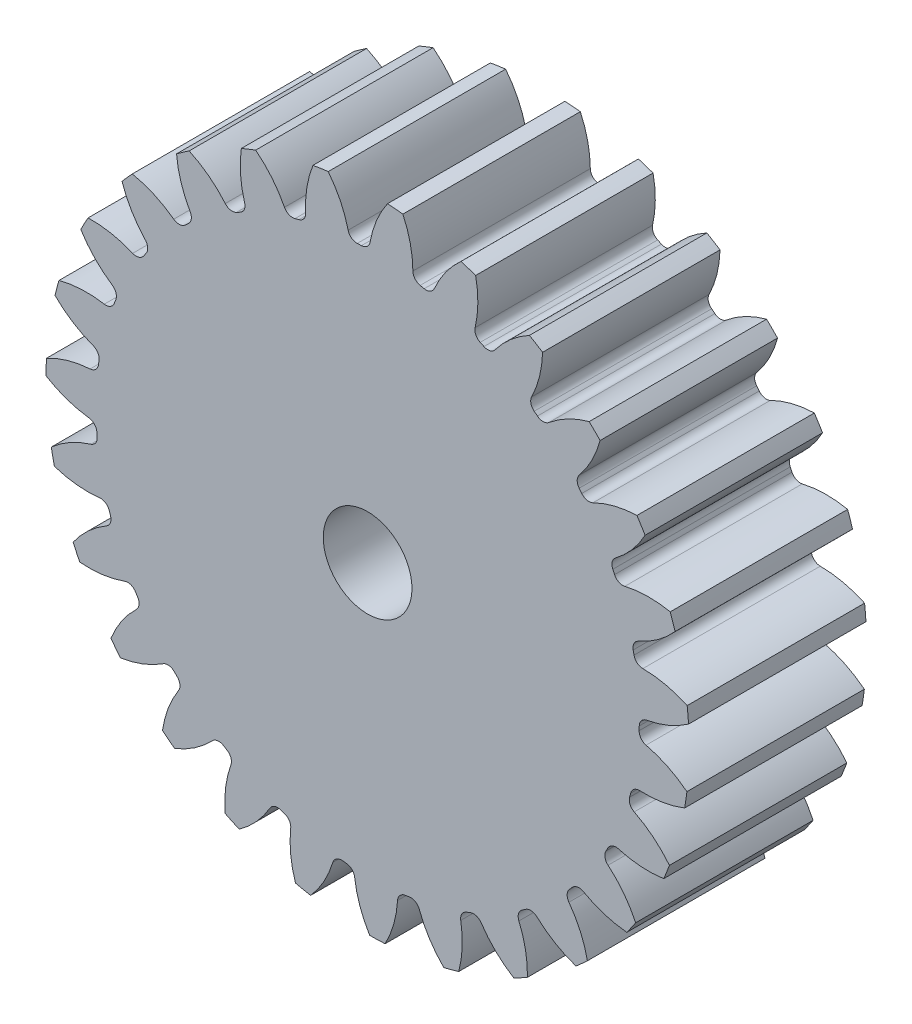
from build123d import *

# Parameters (mm, degrees)
SKETCH3_R         = 184.15
GEARBODY_DEPTH    = 101.6
TOOTHCUT_DEPTH    = 280.544280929
CIRPATTERN1_COUNT = 27
BOREDIA_R         = 25.4
BORE_DEPTH        = 12700


with BuildPart() as part:
    # Sketch3 → gearBody (new body)
    with BuildSketch(Plane.XY):
        Circle(SKETCH3_R)
    extrude(amount=GEARBODY_DEPTH)

    # Sketch2 → toothCut (cut, through all)
    with BuildSketch(Plane.XY):
        with BuildLine():
            ThreePointArc((155.478107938, -5.489861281), (155.515438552, -4.304532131), (155.543732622, -3.118952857))
            ThreePointArc((155.543732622, -3.118952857), (156.774829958, 0.126961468), (159.781695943, 1.861988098))
            ThreePointArc((159.781695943, 1.861988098), (172.533742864, 5.675613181), (184.15, 12.173382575))
            ThreePointArc((184.15, 12.173382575), (184.481271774, -5.106281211), (183.19466737, -22.341163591))
            ThreePointArc((183.19466737, -22.341163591), (171.955625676, -15.210779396), (159.434057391, -10.697602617))
            ThreePointArc((159.434057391, -10.697602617), (156.527769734, -8.798905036), (155.478107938, -5.489861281))
        make_face()
    toothcut = extrude(amount=TOOTHCUT_DEPTH, mode=Mode.SUBTRACT)

    # CirPattern1: toothCut ×27 about axis
    cirpattern1_axis = Axis((0, 0, 0), (0, 0, 1))
    for i in range(1, CIRPATTERN1_COUNT):
        add(toothcut.rotate(cirpattern1_axis, i * 360 / CIRPATTERN1_COUNT), mode=Mode.SUBTRACT)

    # boreDia → bore (cut, symmetric)
    with BuildSketch(Plane.XY):
        Circle(BOREDIA_R)
    extrude(amount=BORE_DEPTH, both=True, mode=Mode.SUBTRACT)


solid = part.part
